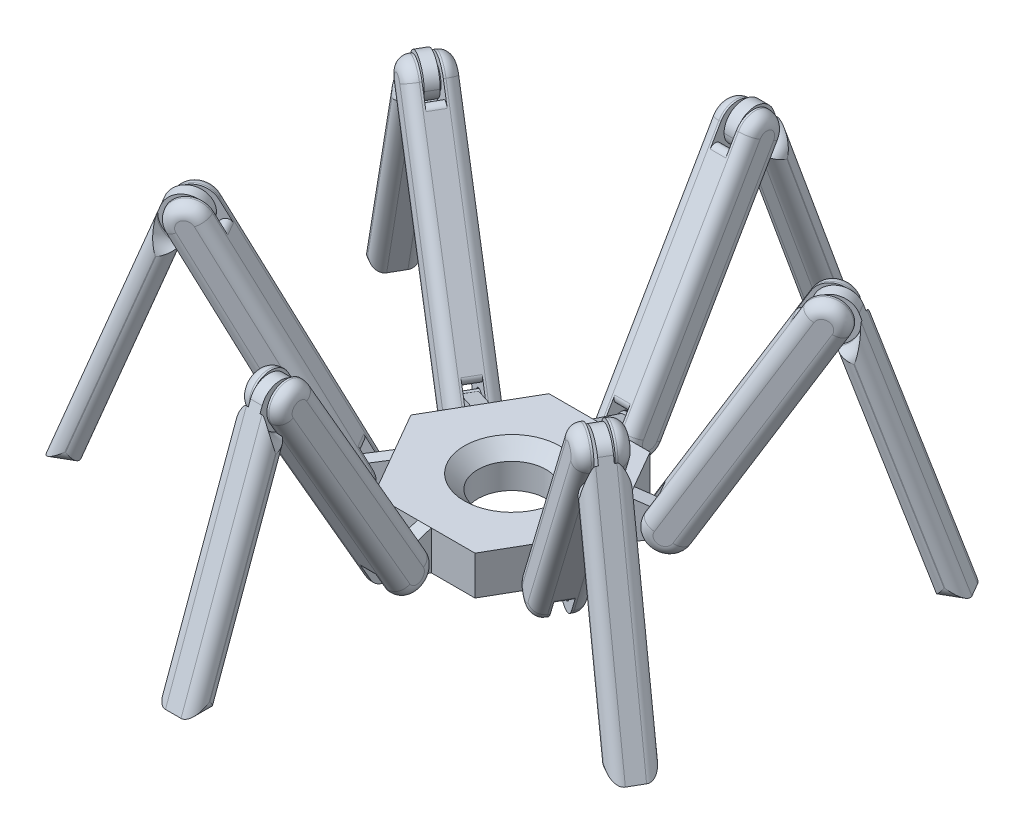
from build123d import *

# Parameters (mm, degrees)
SKETCH1_R           = 17.5
BOSS_EXTRUDE1_DEPTH = 10
CHAMFER1_SIZE       = 7
SKETCH2_R           = 5
BOSS_EXTRUDE2_DEPTH = 7.5
BOSS_EXTRUDE3_DEPTH = 3.5
CIRPATTERN3_COUNT   = 6
BOSS_EXTRUDE4_START = 8
SKETCH4_R           = 5.5
BOSS_EXTRUDE4_DEPTH = 4
BOSS_EXTRUDE5_DEPTH = 4
BOSS_EXTRUDE6_DEPTH = 3
SKETCH7_R           = 5
BOSS_EXTRUDE7_DEPTH = 7
BOSS_EXTRUDE8_DEPTH = 3
BOSS_EXTRUDE9_DEPTH = 7
FILLET1_R           = 6
FILLET2_R           = 6
CIRPATTERN4_COUNT   = 6


with BuildPart() as part:
    # Sketch1 → Boss-Extrude1 (new, symmetric)
    with BuildSketch(Plane(origin=(0, 0, 0), x_dir=(1, 0, 0), z_dir=(0, 1, 0))):
        Polygon((51.961524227, 0), (25.980762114, 45), (-25.980762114, 45), (-51.961524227, 0), (-25.980762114, -45), (25.980762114, -45), align=None)
        with Locations(Location((0, 0, 0), (0, 0, 270))):
            Circle(SKETCH1_R, mode=Mode.SUBTRACT)
    extrude(amount=BOSS_EXTRUDE1_DEPTH, both=True)

    # Chamfer1
    chamfer1_edges = [part.edges().sort_by_distance(p)[0] for p in [
        (0, 10, -17.5),
    ]]
    chamfer(chamfer1_edges, length=CHAMFER1_SIZE)



with BuildPart() as body_2:
    # Sketch2 → Boss-Extrude2 (new, symmetric)
    with BuildSketch(Plane(origin=(0, 0, 0), x_dir=(0, 0, -1), z_dir=(1, 0, 0))):
        with Locations((60, 0)):
            Circle(SKETCH2_R)
    extrude(amount=BOSS_EXTRUDE2_DEPTH, both=True)


with BuildPart() as part_1:
    add(part.part)

    add(body_2.part)  # Boss-Extrude3 merges body 2
    # Sketch3 → Boss-Extrude3 (add, symmetric)
    with BuildSketch(Plane(origin=(0, 0, 0), x_dir=(0, 0, -1), z_dir=(1, 0, 0))):
        Polygon((45, 10), (60, 5), (60, -5), (45, -10), align=None)
    extrude(amount=BOSS_EXTRUDE3_DEPTH, both=True)


with BuildPart() as cirpattern3_1:
    # CirPattern3: pattern copy
    add(part_1.part.rotate(Axis((0, 0, 0), (0, 1, 0)), 1 * 360 / CIRPATTERN3_COUNT))


with BuildPart() as cirpattern3_2:
    # CirPattern3: pattern copy
    add(part_1.part.rotate(Axis((0, 0, 0), (0, 1, 0)), 2 * 360 / CIRPATTERN3_COUNT))


with BuildPart() as cirpattern3_3:
    # CirPattern3: pattern copy
    add(part_1.part.rotate(Axis((0, 0, 0), (0, 1, 0)), 3 * 360 / CIRPATTERN3_COUNT))


with BuildPart() as cirpattern3_4:
    # CirPattern3: pattern copy
    add(part_1.part.rotate(Axis((0, 0, 0), (0, 1, 0)), 4 * 360 / CIRPATTERN3_COUNT))


with BuildPart() as cirpattern3_5:
    # CirPattern3: pattern copy
    add(part_1.part.rotate(Axis((0, 0, 0), (0, 1, 0)), 5 * 360 / CIRPATTERN3_COUNT))


with BuildPart() as cirpattern3_4_1:
    add(cirpattern3_4.part)

    # Combine1: union CirPattern3_3, part, CirPattern3_2, CirPattern3_1, CirPattern3_5
    add(cirpattern3_3.part)
    add(part_1.part)
    add(cirpattern3_2.part)
    add(cirpattern3_1.part)
    add(cirpattern3_5.part)


with BuildPart() as body_2_2:
    # Sketch4 → Boss-Extrude4 (new body)
    with BuildSketch(Plane(origin=(0, 0, 0), x_dir=(0, 0, -1), z_dir=(1, 0, 0)).offset(BOSS_EXTRUDE4_START)):
        with BuildLine():
            Line((51.339745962, 5), (111.339745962, 108.923048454))
            ThreePointArc((111.339745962, 108.923048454), (125, 112.583302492), (128.660254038, 98.923048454))
            Line((128.660254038, 98.923048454), (68.660254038, -5))
            ThreePointArc((68.660254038, -5), (55, -8.660254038), (51.339745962, 5))
        make_face()
        with Locations((60, 0)):
            Circle(SKETCH4_R, mode=Mode.SUBTRACT)
        with Locations((120, 103.923048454)):
            Circle(SKETCH4_R, mode=Mode.SUBTRACT)
    extrude(amount=-BOSS_EXTRUDE4_DEPTH)

    # Sketch5 → Boss-Extrude5 (add)
    with BuildSketch(Plane.ZY.offset(-4)):
        with BuildLine():
            Line((-56.816971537, 14.486832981), (-105.862520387, 99.436215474))
            ThreePointArc((-105.862520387, 99.436215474), (-108.528108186, 100.935455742), (-111.123535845, 99.317792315))
            ThreePointArc((-111.123535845, 99.317792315), (-115, 95.262794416), (-120.44996327, 93.933176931))
            ThreePointArc((-120.44996327, 93.933176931), (-123.148614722, 92.494302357), (-123.183028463, 89.436215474))
            Line((-123.183028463, 89.436215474), (-74.137479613, 4.486832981))
            ThreePointArc((-74.137479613, 4.486832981), (-71.471891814, 2.987592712), (-68.876464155, 4.605256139))
            ThreePointArc((-68.876464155, 4.605256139), (-65, 8.660254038), (-59.55003673, 9.989871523))
            ThreePointArc((-59.55003673, 9.989871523), (-56.851385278, 11.428746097), (-56.816971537, 14.486832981))
        make_face()
    extrude(amount=BOSS_EXTRUDE5_DEPTH)

    # Sketch6 → Boss-Extrude6 (add)
    with BuildSketch(Plane(origin=(8, 0, 0), x_dir=(0, 0, -1), z_dir=(1, 0, 0))):
        with BuildLine():
            Line((68.660254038, -5), (128.660254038, 98.923048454))
            ThreePointArc((128.660254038, 98.923048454), (125, 112.583302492), (111.339745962, 108.923048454))
            Line((111.339745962, 108.923048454), (51.339745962, 5))
            ThreePointArc((51.339745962, 5), (55, -8.660254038), (68.660254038, -5))
        make_face()
    extrude(amount=BOSS_EXTRUDE6_DEPTH)

    # Fillet1
    fillet1_edges = [body_2_2.edges().sort_by_distance(p)[0] for p in [
        (11, -8.660254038, -55),
        (11, 46.961524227, -98.660254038),
        (11, 112.583302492, -125),
        (11, 56.961524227, -81.339745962),
    ]]
    fillet(fillet1_edges, radius=FILLET1_R)

    # Mirror1: body 2 2 across plane


with BuildPart() as body_3:
    # Sketch7 → Boss-Extrude7 (new body)
    with BuildSketch(Plane.ZY):
        with Locations((-120, 103.923048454)):
            Circle(SKETCH7_R)
    extrude(amount=-BOSS_EXTRUDE7_DEPTH)

    # Sketch8 → Boss-Extrude8 (add)
    with BuildSketch(Plane.ZY):
        with BuildLine():
            Line((-123.208110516, 93.955990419), (-161.044996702, -10))
            Line((-161.044996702, -10), (-174.106376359, -10))
            Line((-174.106376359, -10), (-131.396926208, 107.343249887))
            ThreePointArc((-131.396926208, 107.343249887), (-120.263518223, 113.771125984), (-112, 103.923048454))
            ThreePointArc((-112, 103.923048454), (-114.444078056, 98.167031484), (-120.282932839, 95.928053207))
            ThreePointArc((-120.282932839, 95.928053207), (-122.066030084, 95.417434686), (-123.208110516, 93.955990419))
        make_face()
    extrude(amount=-BOSS_EXTRUDE8_DEPTH)

    # Sketch9 → Boss-Extrude9 (add)
    with BuildSketch(Plane(origin=(3, 0, 0), x_dir=(0, 0, -1), z_dir=(1, 0, 0))):
        with BuildLine():
            Line((123.902606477, 92.047878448), (161.044996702, -10))
            Line((161.044996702, -10), (174.106376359, -10))
            Line((174.106376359, -10), (132.493345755, 104.330861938))
            ThreePointArc((132.493345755, 104.330861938), (130.243277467, 96.758882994), (123.902606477, 92.047878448))
        make_face()
    extrude(amount=BOSS_EXTRUDE9_DEPTH)

    # Fillet2
    fillet2_edges = [body_3.edges().sort_by_distance(p)[0] for p in [
        (10, 96.758882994, -130.243277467),
        (10, 41.023939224, -142.47380159),
        (10, -10, -167.575686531),
        (10, 47.165430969, -153.299861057),
    ]]
    fillet(fillet2_edges, radius=FILLET2_R)

    # Mirror1 2: body 3 across plane


with BuildPart() as body_2_2_1:
    add(body_2_2.part)
    add(body_2_2.part.mirror(Plane(origin=(0, 0, 0), x_dir=(0, 0, 1), z_dir=(1, 0, 0))))


with BuildPart() as body_3_1:
    add(body_3.part)
    add(body_3.part.mirror(Plane(origin=(0, 0, 0), x_dir=(0, 0, 1), z_dir=(1, 0, 0))))


with BuildPart() as cirpattern4_1:
    # CirPattern4: pattern copy
    add(body_2_2_1.part.rotate(Axis((0, 0, 0), (0, 1, 0)), 1 * 360 / CIRPATTERN4_COUNT))


with BuildPart() as cirpattern4_2:
    # CirPattern4: pattern copy
    add(body_2_2_1.part.rotate(Axis((0, 0, 0), (0, 1, 0)), 2 * 360 / CIRPATTERN4_COUNT))


with BuildPart() as cirpattern4_3:
    # CirPattern4: pattern copy
    add(body_2_2_1.part.rotate(Axis((0, 0, 0), (0, 1, 0)), 3 * 360 / CIRPATTERN4_COUNT))


with BuildPart() as cirpattern4_4:
    # CirPattern4: pattern copy
    add(body_2_2_1.part.rotate(Axis((0, 0, 0), (0, 1, 0)), 4 * 360 / CIRPATTERN4_COUNT))


with BuildPart() as cirpattern4_5:
    # CirPattern4: pattern copy
    add(body_2_2_1.part.rotate(Axis((0, 0, 0), (0, 1, 0)), 5 * 360 / CIRPATTERN4_COUNT))


with BuildPart() as cirpattern4_6:
    # CirPattern4: pattern copy
    add(body_3_1.part.rotate(Axis((0, 0, 0), (0, 1, 0)), 1 * 360 / CIRPATTERN4_COUNT))


with BuildPart() as cirpattern4_7:
    # CirPattern4: pattern copy
    add(body_3_1.part.rotate(Axis((0, 0, 0), (0, 1, 0)), 2 * 360 / CIRPATTERN4_COUNT))


with BuildPart() as cirpattern4_8:
    # CirPattern4: pattern copy
    add(body_3_1.part.rotate(Axis((0, 0, 0), (0, 1, 0)), 3 * 360 / CIRPATTERN4_COUNT))


with BuildPart() as cirpattern4_9:
    # CirPattern4: pattern copy
    add(body_3_1.part.rotate(Axis((0, 0, 0), (0, 1, 0)), 4 * 360 / CIRPATTERN4_COUNT))


with BuildPart() as cirpattern4_10:
    # CirPattern4: pattern copy
    add(body_3_1.part.rotate(Axis((0, 0, 0), (0, 1, 0)), 5 * 360 / CIRPATTERN4_COUNT))


solid = Compound([cirpattern3_4_1.part, body_2_2_1.part, body_3_1.part, cirpattern4_1.part, cirpattern4_2.part, cirpattern4_3.part, cirpattern4_4.part, cirpattern4_5.part, cirpattern4_6.part, cirpattern4_7.part, cirpattern4_8.part, cirpattern4_9.part, cirpattern4_10.part])
